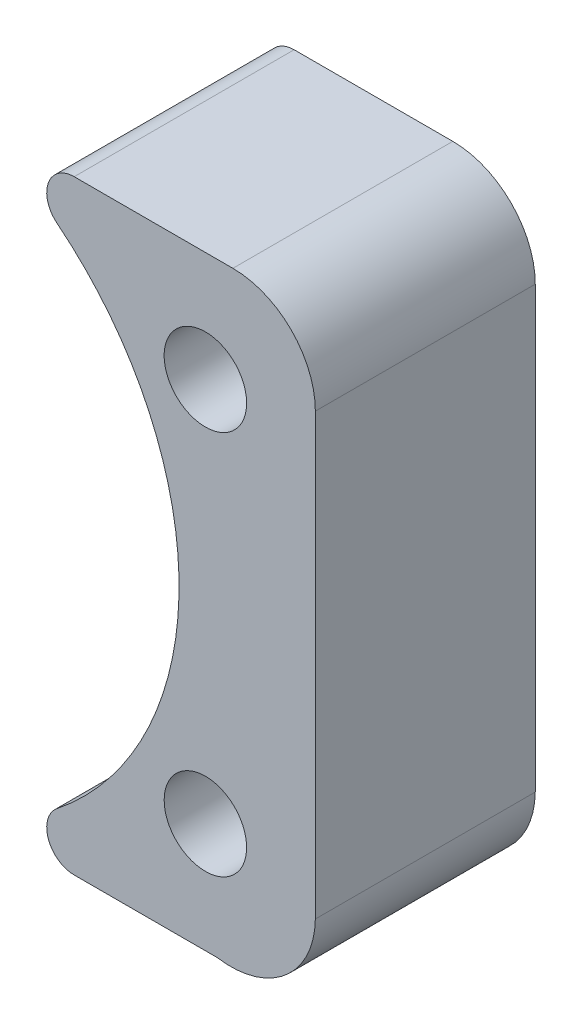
ISO-10303-21;
HEADER;
FILE_DESCRIPTION(('STEP AP214'),'2;1');
FILE_NAME('part.step','',(''),(''),'','','');
FILE_SCHEMA(('AUTOMOTIVE_DESIGN { 1 0 10303 214 1 1 1 1 }'));
ENDSEC;
DATA;
#1=APPLICATION_CONTEXT('core data for automotive mechanical design processes');
#2=APPLICATION_PROTOCOL_DEFINITION('international standard','automotive_design',2000,#1);
#3=PRODUCT_CONTEXT('',#1,'mechanical');
#4=PRODUCT('Part','Part','',(#3));
#5=PRODUCT_RELATED_PRODUCT_CATEGORY('part','',(#4));
#6=PRODUCT_DEFINITION_FORMATION('','',#4);
#7=PRODUCT_DEFINITION_CONTEXT('part definition',#1,'design');
#8=PRODUCT_DEFINITION('design','',#6,#7);
#9=PRODUCT_DEFINITION_SHAPE('','',#8);
#10=(LENGTH_UNIT() NAMED_UNIT(*) SI_UNIT(.MILLI.,.METRE.));
#11=(NAMED_UNIT(*) PLANE_ANGLE_UNIT() SI_UNIT($,.RADIAN.));
#12=(NAMED_UNIT(*) SI_UNIT($,.STERADIAN.) SOLID_ANGLE_UNIT());
#13=UNCERTAINTY_MEASURE_WITH_UNIT(LENGTH_MEASURE(1.E-05),#10,'distance_accuracy_value','');
#14=(GEOMETRIC_REPRESENTATION_CONTEXT(3) GLOBAL_UNCERTAINTY_ASSIGNED_CONTEXT((#13)) GLOBAL_UNIT_ASSIGNED_CONTEXT((#10,
#11,#12)) REPRESENTATION_CONTEXT('',''));
#15=CARTESIAN_POINT('',(0.,0.,0.));
#16=DIRECTION('',(0.,0.,1.));
#17=DIRECTION('',(1.,0.,0.));
#18=AXIS2_PLACEMENT_3D('',#15,#16,#17);
#19=CARTESIAN_POINT('',(12.227935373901,10.,8.));
#20=DIRECTION('',(0.,0.,1.));
#21=DIRECTION('',(1.,0.,0.));
#22=AXIS2_PLACEMENT_3D('',#19,#20,#21);
#23=PLANE('',#22);
#24=CARTESIAN_POINT('',(17.,7.,8.));
#25=DIRECTION('',(0.,0.,1.));
#26=DIRECTION('',(1.,0.,0.));
#27=AXIS2_PLACEMENT_3D('',#24,#25,#26);
#28=CIRCLE('',#27,1.5);
#29=CARTESIAN_POINT('',(18.5,7.,8.));
#30=VERTEX_POINT('',#29);
#31=EDGE_CURVE('E110',#30,#30,#28,.T.);
#32=ORIENTED_EDGE('',*,*,#31,.F.);
#33=EDGE_LOOP('',(#32));
#34=FACE_BOUND('',#33,.T.);
#35=CARTESIAN_POINT('',(12.227935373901,10.,8.));
#36=DIRECTION('',(0.,0.,1.));
#37=DIRECTION('',(1.,0.,0.));
#38=AXIS2_PLACEMENT_3D('',#35,#36,#37);
#39=CIRCLE('',#38,1.);
#40=CARTESIAN_POINT('',(12.227935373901,11.,8.));
#41=VERTEX_POINT('',#40);
#42=CARTESIAN_POINT('',(11.6042926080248,9.21829052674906,8.));
#43=VERTEX_POINT('',#42);
#44=EDGE_CURVE('E128',#41,#43,#39,.T.);
#45=ORIENTED_EDGE('',*,*,#44,.T.);
#46=CARTESIAN_POINT('',(4.24999999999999,0.,8.));
#47=DIRECTION('',(0.,0.,-1.));
#48=DIRECTION('',(-1.,0.,0.));
#49=AXIS2_PLACEMENT_3D('',#46,#47,#48);
#50=CIRCLE('',#49,11.7924764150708);
#51=CARTESIAN_POINT('',(11.6042926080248,-9.21829052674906,8.));
#52=VERTEX_POINT('',#51);
#53=EDGE_CURVE('E105',#43,#52,#50,.T.);
#54=ORIENTED_EDGE('',*,*,#53,.T.);
#55=CARTESIAN_POINT('',(12.227935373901,-10.,8.));
#56=DIRECTION('',(0.,0.,1.));
#57=DIRECTION('',(-1.,0.,0.));
#58=AXIS2_PLACEMENT_3D('',#55,#56,#57);
#59=CIRCLE('',#58,1.);
#60=CARTESIAN_POINT('',(12.227935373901,-11.,8.));
#61=VERTEX_POINT('',#60);
#62=EDGE_CURVE('E131',#52,#61,#59,.T.);
#63=ORIENTED_EDGE('',*,*,#62,.T.);
#64=DIRECTION('',(1.,0.,0.));
#65=VECTOR('',#64,1.);
#66=CARTESIAN_POINT('',(12.227935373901,-11.,8.));
#67=LINE('',#66,#65);
#68=CARTESIAN_POINT('',(17.4286812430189,-11.,8.));
#69=VERTEX_POINT('',#68);
#70=EDGE_CURVE('E133',#61,#69,#67,.T.);
#71=ORIENTED_EDGE('',*,*,#70,.T.);
#72=CARTESIAN_POINT('',(17.9198726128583,-7.9590140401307,8.));
#73=DIRECTION('',(0.,0.,1.));
#74=DIRECTION('',(1.,0.,0.));
#75=AXIS2_PLACEMENT_3D('',#72,#73,#74);
#76=CIRCLE('',#75,3.08040006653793);
#77=CARTESIAN_POINT('',(21.,-7.99999999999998,8.));
#78=VERTEX_POINT('',#77);
#79=EDGE_CURVE('E135',#69,#78,#76,.T.);
#80=ORIENTED_EDGE('',*,*,#79,.T.);
#81=DIRECTION('',(0.,1.,0.));
#82=VECTOR('',#81,1.);
#83=CARTESIAN_POINT('',(21.,-7.99999999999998,8.));
#84=LINE('',#83,#82);
#85=CARTESIAN_POINT('',(21.,8.,8.));
#86=VERTEX_POINT('',#85);
#87=EDGE_CURVE('E137',#78,#86,#84,.T.);
#88=ORIENTED_EDGE('',*,*,#87,.T.);
#89=CARTESIAN_POINT('',(18.,7.99999999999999,8.));
#90=DIRECTION('',(0.,0.,1.));
#91=DIRECTION('',(-1.,0.,0.));
#92=AXIS2_PLACEMENT_3D('',#89,#90,#91);
#93=CIRCLE('',#92,3.00000000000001);
#94=CARTESIAN_POINT('',(18.,11.,8.));
#95=VERTEX_POINT('',#94);
#96=EDGE_CURVE('E46',#86,#95,#93,.T.);
#97=ORIENTED_EDGE('',*,*,#96,.T.);
#98=DIRECTION('',(-1.,0.,0.));
#99=VECTOR('',#98,1.);
#100=CARTESIAN_POINT('',(12.227935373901,11.,8.));
#101=LINE('',#100,#99);
#102=EDGE_CURVE('E41',#95,#41,#101,.T.);
#103=ORIENTED_EDGE('',*,*,#102,.T.);
#104=EDGE_LOOP('',(#45,#54,#63,#71,#80,#88,#97,#103));
#105=FACE_BOUND('',#104,.T.);
#106=CARTESIAN_POINT('',(17.,-7.,8.));
#107=DIRECTION('',(0.,0.,1.));
#108=DIRECTION('',(-1.,0.,0.));
#109=AXIS2_PLACEMENT_3D('',#106,#107,#108);
#110=CIRCLE('',#109,1.5);
#111=CARTESIAN_POINT('',(15.5,-7.,8.));
#112=VERTEX_POINT('',#111);
#113=EDGE_CURVE('E208',#112,#112,#110,.T.);
#114=ORIENTED_EDGE('',*,*,#113,.F.);
#115=EDGE_LOOP('',(#114));
#116=FACE_BOUND('',#115,.T.);
#117=ADVANCED_FACE('F26',(#34,#105,#116),#23,.T.);
#118=CARTESIAN_POINT('',(12.227935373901,10.,0.));
#119=DIRECTION('',(0.,0.,1.));
#120=DIRECTION('',(1.,0.,0.));
#121=AXIS2_PLACEMENT_3D('',#118,#119,#120);
#122=PLANE('',#121);
#123=CARTESIAN_POINT('',(17.,7.,0.));
#124=DIRECTION('',(0.,0.,1.));
#125=DIRECTION('',(1.,0.,0.));
#126=AXIS2_PLACEMENT_3D('',#123,#124,#125);
#127=CIRCLE('',#126,1.5);
#128=CARTESIAN_POINT('',(18.5,7.,0.));
#129=VERTEX_POINT('',#128);
#130=EDGE_CURVE('E113',#129,#129,#127,.T.);
#131=ORIENTED_EDGE('',*,*,#130,.T.);
#132=EDGE_LOOP('',(#131));
#133=FACE_BOUND('',#132,.T.);
#134=CARTESIAN_POINT('',(12.227935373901,10.,0.));
#135=DIRECTION('',(0.,0.,1.));
#136=DIRECTION('',(1.,0.,0.));
#137=AXIS2_PLACEMENT_3D('',#134,#135,#136);
#138=CIRCLE('',#137,1.);
#139=CARTESIAN_POINT('',(12.227935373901,11.,0.));
#140=VERTEX_POINT('',#139);
#141=CARTESIAN_POINT('',(11.6042926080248,9.21829052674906,0.));
#142=VERTEX_POINT('',#141);
#143=EDGE_CURVE('E96',#140,#142,#138,.T.);
#144=ORIENTED_EDGE('',*,*,#143,.F.);
#145=DIRECTION('',(-1.,0.,0.));
#146=VECTOR('',#145,1.);
#147=CARTESIAN_POINT('',(12.227935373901,11.,0.));
#148=LINE('',#147,#146);
#149=CARTESIAN_POINT('',(18.,11.,0.));
#150=VERTEX_POINT('',#149);
#151=EDGE_CURVE('E126',#150,#140,#148,.T.);
#152=ORIENTED_EDGE('',*,*,#151,.F.);
#153=CARTESIAN_POINT('',(18.,7.99999999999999,0.));
#154=DIRECTION('',(0.,0.,1.));
#155=DIRECTION('',(-1.,0.,0.));
#156=AXIS2_PLACEMENT_3D('',#153,#154,#155);
#157=CIRCLE('',#156,3.00000000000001);
#158=CARTESIAN_POINT('',(21.,8.,0.));
#159=VERTEX_POINT('',#158);
#160=EDGE_CURVE('E124',#159,#150,#157,.T.);
#161=ORIENTED_EDGE('',*,*,#160,.F.);
#162=DIRECTION('',(0.,1.,0.));
#163=VECTOR('',#162,1.);
#164=CARTESIAN_POINT('',(21.,-7.99999999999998,0.));
#165=LINE('',#164,#163);
#166=CARTESIAN_POINT('',(21.,-7.99999999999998,0.));
#167=VERTEX_POINT('',#166);
#168=EDGE_CURVE('E122',#167,#159,#165,.T.);
#169=ORIENTED_EDGE('',*,*,#168,.F.);
#170=CARTESIAN_POINT('',(17.9198726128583,-7.9590140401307,0.));
#171=DIRECTION('',(0.,0.,1.));
#172=DIRECTION('',(1.,0.,0.));
#173=AXIS2_PLACEMENT_3D('',#170,#171,#172);
#174=CIRCLE('',#173,3.08040006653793);
#175=CARTESIAN_POINT('',(17.4286812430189,-11.,0.));
#176=VERTEX_POINT('',#175);
#177=EDGE_CURVE('E120',#176,#167,#174,.T.);
#178=ORIENTED_EDGE('',*,*,#177,.F.);
#179=DIRECTION('',(1.,0.,0.));
#180=VECTOR('',#179,1.);
#181=CARTESIAN_POINT('',(12.227935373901,-11.,0.));
#182=LINE('',#181,#180);
#183=CARTESIAN_POINT('',(12.227935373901,-11.,0.));
#184=VERTEX_POINT('',#183);
#185=EDGE_CURVE('E118',#184,#176,#182,.T.);
#186=ORIENTED_EDGE('',*,*,#185,.F.);
#187=CARTESIAN_POINT('',(12.227935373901,-10.,0.));
#188=DIRECTION('',(0.,0.,1.));
#189=DIRECTION('',(-1.,0.,0.));
#190=AXIS2_PLACEMENT_3D('',#187,#188,#189);
#191=CIRCLE('',#190,1.);
#192=CARTESIAN_POINT('',(11.6042926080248,-9.21829052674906,0.));
#193=VERTEX_POINT('',#192);
#194=EDGE_CURVE('E98',#193,#184,#191,.T.);
#195=ORIENTED_EDGE('',*,*,#194,.F.);
#196=CARTESIAN_POINT('',(4.24999999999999,0.,0.));
#197=DIRECTION('',(0.,0.,-1.));
#198=DIRECTION('',(-1.,0.,0.));
#199=AXIS2_PLACEMENT_3D('',#196,#197,#198);
#200=CIRCLE('',#199,11.7924764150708);
#201=EDGE_CURVE('E91',#142,#193,#200,.T.);
#202=ORIENTED_EDGE('',*,*,#201,.F.);
#203=EDGE_LOOP('',(#144,#152,#161,#169,#178,#186,#195,#202));
#204=FACE_BOUND('',#203,.T.);
#205=CARTESIAN_POINT('',(17.,-7.,0.));
#206=DIRECTION('',(0.,0.,1.));
#207=DIRECTION('',(-1.,0.,0.));
#208=AXIS2_PLACEMENT_3D('',#205,#206,#207);
#209=CIRCLE('',#208,1.5);
#210=CARTESIAN_POINT('',(15.5,-7.,0.));
#211=VERTEX_POINT('',#210);
#212=EDGE_CURVE('E211',#211,#211,#209,.T.);
#213=ORIENTED_EDGE('',*,*,#212,.T.);
#214=EDGE_LOOP('',(#213));
#215=FACE_BOUND('',#214,.T.);
#216=ADVANCED_FACE('F92',(#133,#204,#215),#122,.F.);
#217=CARTESIAN_POINT('',(12.227935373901,10.,8.));
#218=DIRECTION('',(0.,0.,-1.));
#219=DIRECTION('',(-1.,0.,0.));
#220=AXIS2_PLACEMENT_3D('',#217,#218,#219);
#221=CYLINDRICAL_SURFACE('',#220,1.);
#222=ORIENTED_EDGE('',*,*,#143,.T.);
#223=DIRECTION('',(0.,0.,-1.));
#224=VECTOR('',#223,1.);
#225=CARTESIAN_POINT('',(11.6042926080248,9.21829052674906,8.));
#226=LINE('',#225,#224);
#227=EDGE_CURVE('E11',#43,#142,#226,.T.);
#228=ORIENTED_EDGE('',*,*,#227,.F.);
#229=ORIENTED_EDGE('',*,*,#44,.F.);
#230=DIRECTION('',(0.,0.,-1.));
#231=VECTOR('',#230,1.);
#232=CARTESIAN_POINT('',(12.227935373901,11.,8.));
#233=LINE('',#232,#231);
#234=EDGE_CURVE('E109',#41,#140,#233,.T.);
#235=ORIENTED_EDGE('',*,*,#234,.T.);
#236=EDGE_LOOP('',(#222,#228,#229,#235));
#237=FACE_BOUND('',#236,.T.);
#238=ADVANCED_FACE('F28',(#237),#221,.T.);
#239=CARTESIAN_POINT('',(4.24999999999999,0.,8.));
#240=DIRECTION('',(0.,0.,-1.));
#241=DIRECTION('',(-1.,0.,0.));
#242=AXIS2_PLACEMENT_3D('',#239,#240,#241);
#243=CYLINDRICAL_SURFACE('',#242,11.7924764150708);
#244=ORIENTED_EDGE('',*,*,#201,.T.);
#245=DIRECTION('',(0.,0.,-1.));
#246=VECTOR('',#245,1.);
#247=CARTESIAN_POINT('',(11.6042926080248,-9.21829052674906,8.));
#248=LINE('',#247,#246);
#249=EDGE_CURVE('E34',#52,#193,#248,.T.);
#250=ORIENTED_EDGE('',*,*,#249,.F.);
#251=ORIENTED_EDGE('',*,*,#53,.F.);
#252=ORIENTED_EDGE('',*,*,#227,.T.);
#253=EDGE_LOOP('',(#244,#250,#251,#252));
#254=FACE_BOUND('',#253,.T.);
#255=ADVANCED_FACE('F104',(#254),#243,.F.);
#256=CARTESIAN_POINT('',(12.227935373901,-10.,8.));
#257=DIRECTION('',(0.,0.,-1.));
#258=DIRECTION('',(-1.,0.,0.));
#259=AXIS2_PLACEMENT_3D('',#256,#257,#258);
#260=CYLINDRICAL_SURFACE('',#259,1.);
#261=ORIENTED_EDGE('',*,*,#194,.T.);
#262=DIRECTION('',(0.,0.,-1.));
#263=VECTOR('',#262,1.);
#264=CARTESIAN_POINT('',(12.227935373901,-11.,8.));
#265=LINE('',#264,#263);
#266=EDGE_CURVE('E154',#61,#184,#265,.T.);
#267=ORIENTED_EDGE('',*,*,#266,.F.);
#268=ORIENTED_EDGE('',*,*,#62,.F.);
#269=ORIENTED_EDGE('',*,*,#249,.T.);
#270=EDGE_LOOP('',(#261,#267,#268,#269));
#271=FACE_BOUND('',#270,.T.);
#272=ADVANCED_FACE('F158',(#271),#260,.T.);
#273=CARTESIAN_POINT('',(12.227935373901,-11.,8.));
#274=DIRECTION('',(0.,1.,0.));
#275=DIRECTION('',(-1.,0.,0.));
#276=AXIS2_PLACEMENT_3D('',#273,#274,#275);
#277=PLANE('',#276);
#278=ORIENTED_EDGE('',*,*,#185,.T.);
#279=DIRECTION('',(0.,0.,-1.));
#280=VECTOR('',#279,1.);
#281=CARTESIAN_POINT('',(17.4286812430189,-11.,8.));
#282=LINE('',#281,#280);
#283=EDGE_CURVE('E151',#69,#176,#282,.T.);
#284=ORIENTED_EDGE('',*,*,#283,.F.);
#285=ORIENTED_EDGE('',*,*,#70,.F.);
#286=ORIENTED_EDGE('',*,*,#266,.T.);
#287=EDGE_LOOP('',(#278,#284,#285,#286));
#288=FACE_BOUND('',#287,.T.);
#289=ADVANCED_FACE('F166',(#288),#277,.F.);
#290=CARTESIAN_POINT('',(17.9198726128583,-7.9590140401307,8.));
#291=DIRECTION('',(0.,0.,-1.));
#292=DIRECTION('',(-1.,0.,0.));
#293=AXIS2_PLACEMENT_3D('',#290,#291,#292);
#294=CYLINDRICAL_SURFACE('',#293,3.08040006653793);
#295=ORIENTED_EDGE('',*,*,#177,.T.);
#296=DIRECTION('',(0.,0.,-1.));
#297=VECTOR('',#296,1.);
#298=CARTESIAN_POINT('',(21.,-7.99999999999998,8.));
#299=LINE('',#298,#297);
#300=EDGE_CURVE('E148',#78,#167,#299,.T.);
#301=ORIENTED_EDGE('',*,*,#300,.F.);
#302=ORIENTED_EDGE('',*,*,#79,.F.);
#303=ORIENTED_EDGE('',*,*,#283,.T.);
#304=EDGE_LOOP('',(#295,#301,#302,#303));
#305=FACE_BOUND('',#304,.T.);
#306=ADVANCED_FACE('F169',(#305),#294,.T.);
#307=CARTESIAN_POINT('',(21.,-7.99999999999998,8.));
#308=DIRECTION('',(-1.,0.,0.));
#309=DIRECTION('',(0.,0.,1.));
#310=AXIS2_PLACEMENT_3D('',#307,#308,#309);
#311=PLANE('',#310);
#312=ORIENTED_EDGE('',*,*,#168,.T.);
#313=DIRECTION('',(0.,0.,-1.));
#314=VECTOR('',#313,1.);
#315=CARTESIAN_POINT('',(21.,8.,8.));
#316=LINE('',#315,#314);
#317=EDGE_CURVE('E145',#86,#159,#316,.T.);
#318=ORIENTED_EDGE('',*,*,#317,.F.);
#319=ORIENTED_EDGE('',*,*,#87,.F.);
#320=ORIENTED_EDGE('',*,*,#300,.T.);
#321=EDGE_LOOP('',(#312,#318,#319,#320));
#322=FACE_BOUND('',#321,.T.);
#323=ADVANCED_FACE('F174',(#322),#311,.F.);
#324=CARTESIAN_POINT('',(18.,7.99999999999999,8.));
#325=DIRECTION('',(0.,0.,-1.));
#326=DIRECTION('',(-1.,0.,0.));
#327=AXIS2_PLACEMENT_3D('',#324,#325,#326);
#328=CYLINDRICAL_SURFACE('',#327,3.00000000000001);
#329=ORIENTED_EDGE('',*,*,#160,.T.);
#330=DIRECTION('',(0.,0.,-1.));
#331=VECTOR('',#330,1.);
#332=CARTESIAN_POINT('',(18.,11.,8.));
#333=LINE('',#332,#331);
#334=EDGE_CURVE('E142',#95,#150,#333,.T.);
#335=ORIENTED_EDGE('',*,*,#334,.F.);
#336=ORIENTED_EDGE('',*,*,#96,.F.);
#337=ORIENTED_EDGE('',*,*,#317,.T.);
#338=EDGE_LOOP('',(#329,#335,#336,#337));
#339=FACE_BOUND('',#338,.T.);
#340=ADVANCED_FACE('F177',(#339),#328,.T.);
#341=CARTESIAN_POINT('',(12.227935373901,11.,8.));
#342=DIRECTION('',(0.,-1.,0.));
#343=DIRECTION('',(1.,0.,0.));
#344=AXIS2_PLACEMENT_3D('',#341,#342,#343);
#345=PLANE('',#344);
#346=ORIENTED_EDGE('',*,*,#151,.T.);
#347=ORIENTED_EDGE('',*,*,#234,.F.);
#348=ORIENTED_EDGE('',*,*,#102,.F.);
#349=ORIENTED_EDGE('',*,*,#334,.T.);
#350=EDGE_LOOP('',(#346,#347,#348,#349));
#351=FACE_BOUND('',#350,.T.);
#352=ADVANCED_FACE('F179',(#351),#345,.F.);
#353=CARTESIAN_POINT('',(17.,7.,8.));
#354=DIRECTION('',(0.,0.,-1.));
#355=DIRECTION('',(-1.,0.,0.));
#356=AXIS2_PLACEMENT_3D('',#353,#354,#355);
#357=CYLINDRICAL_SURFACE('',#356,1.5);
#358=ORIENTED_EDGE('',*,*,#31,.T.);
#359=EDGE_LOOP('',(#358));
#360=FACE_BOUND('',#359,.T.);
#361=ORIENTED_EDGE('',*,*,#130,.F.);
#362=EDGE_LOOP('',(#361));
#363=FACE_BOUND('',#362,.T.);
#364=ADVANCED_FACE('F181',(#360,#363),#357,.F.);
#365=CARTESIAN_POINT('',(17.,-7.,8.));
#366=DIRECTION('',(0.,0.,-1.));
#367=DIRECTION('',(-1.,0.,0.));
#368=AXIS2_PLACEMENT_3D('',#365,#366,#367);
#369=CYLINDRICAL_SURFACE('',#368,1.5);
#370=ORIENTED_EDGE('',*,*,#113,.T.);
#371=EDGE_LOOP('',(#370));
#372=FACE_BOUND('',#371,.T.);
#373=ORIENTED_EDGE('',*,*,#212,.F.);
#374=EDGE_LOOP('',(#373));
#375=FACE_BOUND('',#374,.T.);
#376=ADVANCED_FACE('F187',(#372,#375),#369,.F.);
#377=CLOSED_SHELL('',(#117,#216,#238,#255,#272,#289,#306,#323,#340,#352,#364,#376));
#378=MANIFOLD_SOLID_BREP('B2',#377);
#379=ADVANCED_BREP_SHAPE_REPRESENTATION('',(#18,#378),#14);
#380=SHAPE_DEFINITION_REPRESENTATION(#9,#379);
ENDSEC;
END-ISO-10303-21;
